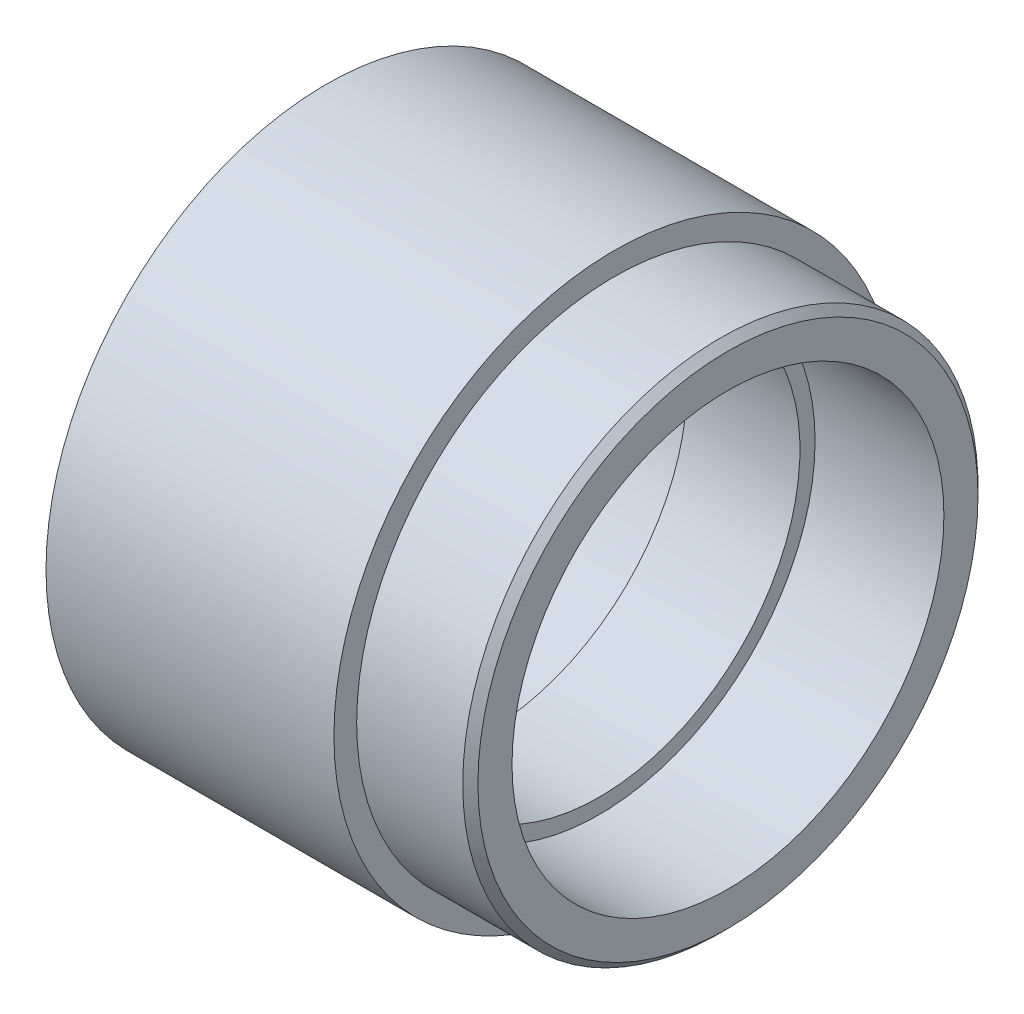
ISO-10303-21;
HEADER;
FILE_DESCRIPTION(('STEP AP214'),'2;1');
FILE_NAME('part.step','',(''),(''),'','','');
FILE_SCHEMA(('AUTOMOTIVE_DESIGN { 1 0 10303 214 1 1 1 1 }'));
ENDSEC;
DATA;
#1=APPLICATION_CONTEXT('core data for automotive mechanical design processes');
#2=APPLICATION_PROTOCOL_DEFINITION('international standard','automotive_design',2000,#1);
#3=PRODUCT_CONTEXT('',#1,'mechanical');
#4=PRODUCT('Part','Part','',(#3));
#5=PRODUCT_RELATED_PRODUCT_CATEGORY('part','',(#4));
#6=PRODUCT_DEFINITION_FORMATION('','',#4);
#7=PRODUCT_DEFINITION_CONTEXT('part definition',#1,'design');
#8=PRODUCT_DEFINITION('design','',#6,#7);
#9=PRODUCT_DEFINITION_SHAPE('','',#8);
#10=(LENGTH_UNIT() NAMED_UNIT(*) SI_UNIT(.MILLI.,.METRE.));
#11=(NAMED_UNIT(*) PLANE_ANGLE_UNIT() SI_UNIT($,.RADIAN.));
#12=(NAMED_UNIT(*) SI_UNIT($,.STERADIAN.) SOLID_ANGLE_UNIT());
#13=UNCERTAINTY_MEASURE_WITH_UNIT(LENGTH_MEASURE(1.E-05),#10,'distance_accuracy_value','');
#14=(GEOMETRIC_REPRESENTATION_CONTEXT(3) GLOBAL_UNCERTAINTY_ASSIGNED_CONTEXT((#13)) GLOBAL_UNIT_ASSIGNED_CONTEXT((#10,
#11,#12)) REPRESENTATION_CONTEXT('',''));
#15=CARTESIAN_POINT('',(0.,0.,0.));
#16=DIRECTION('',(0.,0.,1.));
#17=DIRECTION('',(1.,0.,0.));
#18=AXIS2_PLACEMENT_3D('',#15,#16,#17);
#19=CARTESIAN_POINT('',(11.104537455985,37.,0.));
#20=DIRECTION('',(1.,0.,0.));
#21=DIRECTION('',(0.,0.,-1.));
#22=AXIS2_PLACEMENT_3D('',#19,#20,#21);
#23=PLANE('',#22);
#24=CARTESIAN_POINT('',(11.104537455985,3.40419627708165E-13,-32.5));
#25=DIRECTION('',(-1.,0.,0.));
#26=DIRECTION('',(0.,0.,1.));
#27=AXIS2_PLACEMENT_3D('',#24,#25,#26);
#28=CIRCLE('',#27,2.);
#29=CARTESIAN_POINT('',(11.104537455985,3.40419627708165E-13,-30.5));
#30=VERTEX_POINT('',#29);
#31=EDGE_CURVE('E68',#30,#30,#28,.T.);
#32=ORIENTED_EDGE('',*,*,#31,.F.);
#33=EDGE_LOOP('',(#32));
#34=FACE_BOUND('',#33,.T.);
#35=CARTESIAN_POINT('',(11.104537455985,-32.5,-2.2694641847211E-13));
#36=DIRECTION('',(-1.,0.,0.));
#37=DIRECTION('',(0.,0.,1.));
#38=AXIS2_PLACEMENT_3D('',#35,#36,#37);
#39=CIRCLE('',#38,2.);
#40=CARTESIAN_POINT('',(11.104537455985,-32.5,1.99999999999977));
#41=VERTEX_POINT('',#40);
#42=EDGE_CURVE('E80',#41,#41,#39,.T.);
#43=ORIENTED_EDGE('',*,*,#42,.F.);
#44=EDGE_LOOP('',(#43));
#45=FACE_BOUND('',#44,.T.);
#46=CARTESIAN_POINT('',(11.104537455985,-1.13473209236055E-13,32.5));
#47=DIRECTION('',(-1.,0.,0.));
#48=DIRECTION('',(0.,0.,1.));
#49=AXIS2_PLACEMENT_3D('',#46,#47,#48);
#50=CIRCLE('',#49,2.);
#51=CARTESIAN_POINT('',(11.104537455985,-1.13473209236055E-13,34.5));
#52=VERTEX_POINT('',#51);
#53=EDGE_CURVE('E92',#52,#52,#50,.T.);
#54=ORIENTED_EDGE('',*,*,#53,.F.);
#55=EDGE_LOOP('',(#54));
#56=FACE_BOUND('',#55,.T.);
#57=CARTESIAN_POINT('',(11.104537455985,32.5,0.));
#58=DIRECTION('',(-1.,0.,0.));
#59=DIRECTION('',(0.,0.,1.));
#60=AXIS2_PLACEMENT_3D('',#57,#58,#59);
#61=CIRCLE('',#60,1.99999999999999);
#62=CARTESIAN_POINT('',(11.104537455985,32.5,1.99999999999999));
#63=VERTEX_POINT('',#62);
#64=EDGE_CURVE('E104',#63,#63,#61,.T.);
#65=ORIENTED_EDGE('',*,*,#64,.F.);
#66=EDGE_LOOP('',(#65));
#67=FACE_BOUND('',#66,.T.);
#68=CARTESIAN_POINT('',(11.104537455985,0.,0.));
#69=DIRECTION('',(1.,0.,0.));
#70=DIRECTION('',(0.,0.,-1.));
#71=AXIS2_PLACEMENT_3D('',#68,#69,#70);
#72=CIRCLE('',#71,29.5);
#73=CARTESIAN_POINT('',(11.104537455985,0.,-29.5));
#74=VERTEX_POINT('',#73);
#75=EDGE_CURVE('E134',#74,#74,#72,.T.);
#76=ORIENTED_EDGE('',*,*,#75,.T.);
#77=EDGE_LOOP('',(#76));
#78=FACE_BOUND('',#77,.T.);
#79=CARTESIAN_POINT('',(11.104537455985,0.,0.));
#80=DIRECTION('',(-1.,0.,0.));
#81=DIRECTION('',(0.,0.,1.));
#82=AXIS2_PLACEMENT_3D('',#79,#80,#81);
#83=CIRCLE('',#82,37.);
#84=CARTESIAN_POINT('',(11.104537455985,0.,37.));
#85=VERTEX_POINT('',#84);
#86=EDGE_CURVE('E128',#85,#85,#83,.T.);
#87=ORIENTED_EDGE('',*,*,#86,.T.);
#88=EDGE_LOOP('',(#87));
#89=FACE_BOUND('',#88,.T.);
#90=ADVANCED_FACE('F31',(#34,#45,#56,#67,#78,#89),#23,.F.);
#91=CARTESIAN_POINT('',(-8.50676589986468,0.,0.));
#92=DIRECTION('',(-1.,0.,0.));
#93=DIRECTION('',(0.,0.,1.));
#94=AXIS2_PLACEMENT_3D('',#91,#92,#93);
#95=CYLINDRICAL_SURFACE('',#94,37.);
#96=ORIENTED_EDGE('',*,*,#86,.F.);
#97=EDGE_LOOP('',(#96));
#98=FACE_BOUND('',#97,.T.);
#99=CARTESIAN_POINT('',(49.104537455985,0.,0.));
#100=DIRECTION('',(-1.,0.,0.));
#101=DIRECTION('',(0.,0.,1.));
#102=AXIS2_PLACEMENT_3D('',#99,#100,#101);
#103=CIRCLE('',#102,37.);
#104=CARTESIAN_POINT('',(49.104537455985,0.,37.));
#105=VERTEX_POINT('',#104);
#106=EDGE_CURVE('E125',#105,#105,#103,.T.);
#107=ORIENTED_EDGE('',*,*,#106,.T.);
#108=EDGE_LOOP('',(#107));
#109=FACE_BOUND('',#108,.T.);
#110=ADVANCED_FACE('F160',(#98,#109),#95,.T.);
#111=CARTESIAN_POINT('',(49.104537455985,34.,0.));
#112=DIRECTION('',(-1.,0.,0.));
#113=DIRECTION('',(0.,0.,1.));
#114=AXIS2_PLACEMENT_3D('',#111,#112,#113);
#115=PLANE('',#114);
#116=ORIENTED_EDGE('',*,*,#106,.F.);
#117=EDGE_LOOP('',(#116));
#118=FACE_BOUND('',#117,.T.);
#119=CARTESIAN_POINT('',(49.104537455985,0.,0.));
#120=DIRECTION('',(-1.,0.,0.));
#121=DIRECTION('',(0.,0.,1.));
#122=AXIS2_PLACEMENT_3D('',#119,#120,#121);
#123=CIRCLE('',#122,34.);
#124=CARTESIAN_POINT('',(49.104537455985,0.,34.));
#125=VERTEX_POINT('',#124);
#126=EDGE_CURVE('E122',#125,#125,#123,.T.);
#127=ORIENTED_EDGE('',*,*,#126,.T.);
#128=EDGE_LOOP('',(#127));
#129=FACE_BOUND('',#128,.T.);
#130=ADVANCED_FACE('F167',(#118,#129),#115,.F.);
#131=CARTESIAN_POINT('',(-8.50676589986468,0.,0.));
#132=DIRECTION('',(-1.,0.,0.));
#133=DIRECTION('',(0.,0.,1.));
#134=AXIS2_PLACEMENT_3D('',#131,#132,#133);
#135=CYLINDRICAL_SURFACE('',#134,34.);
#136=CARTESIAN_POINT('',(63.104537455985,0.,0.));
#137=DIRECTION('',(-1.,0.,0.));
#138=DIRECTION('',(0.,0.,1.));
#139=AXIS2_PLACEMENT_3D('',#136,#137,#138);
#140=CIRCLE('',#139,34.);
#141=CARTESIAN_POINT('',(63.104537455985,0.,34.));
#142=VERTEX_POINT('',#141);
#143=EDGE_CURVE('E38',#142,#142,#140,.T.);
#144=ORIENTED_EDGE('',*,*,#143,.T.);
#145=EDGE_LOOP('',(#144));
#146=FACE_BOUND('',#145,.T.);
#147=ORIENTED_EDGE('',*,*,#126,.F.);
#148=EDGE_LOOP('',(#147));
#149=FACE_BOUND('',#148,.T.);
#150=ADVANCED_FACE('F139',(#146,#149),#135,.T.);
#151=CARTESIAN_POINT('',(64.104537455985,28.5,0.));
#152=DIRECTION('',(-1.,0.,0.));
#153=DIRECTION('',(0.,0.,1.));
#154=AXIS2_PLACEMENT_3D('',#151,#152,#153);
#155=PLANE('',#154);
#156=CARTESIAN_POINT('',(64.104537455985,0.,0.));
#157=DIRECTION('',(-1.,0.,0.));
#158=DIRECTION('',(0.,0.,1.));
#159=AXIS2_PLACEMENT_3D('',#156,#157,#158);
#160=CIRCLE('',#159,33.);
#161=CARTESIAN_POINT('',(64.104537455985,0.,33.));
#162=VERTEX_POINT('',#161);
#163=EDGE_CURVE('E11',#162,#162,#160,.F.);
#164=ORIENTED_EDGE('',*,*,#163,.T.);
#165=EDGE_LOOP('',(#164));
#166=FACE_BOUND('',#165,.T.);
#167=CARTESIAN_POINT('',(64.104537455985,0.,0.));
#168=DIRECTION('',(-1.,0.,0.));
#169=DIRECTION('',(0.,0.,1.));
#170=AXIS2_PLACEMENT_3D('',#167,#168,#169);
#171=CIRCLE('',#170,28.5);
#172=CARTESIAN_POINT('',(64.104537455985,0.,28.5));
#173=VERTEX_POINT('',#172);
#174=EDGE_CURVE('E119',#173,#173,#171,.T.);
#175=ORIENTED_EDGE('',*,*,#174,.T.);
#176=EDGE_LOOP('',(#175));
#177=FACE_BOUND('',#176,.T.);
#178=ADVANCED_FACE('F188',(#166,#177),#155,.F.);
#179=CARTESIAN_POINT('',(-8.50676589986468,0.,0.));
#180=DIRECTION('',(-1.,0.,0.));
#181=DIRECTION('',(0.,0.,1.));
#182=AXIS2_PLACEMENT_3D('',#179,#180,#181);
#183=CYLINDRICAL_SURFACE('',#182,28.5);
#184=ORIENTED_EDGE('',*,*,#174,.F.);
#185=EDGE_LOOP('',(#184));
#186=FACE_BOUND('',#185,.T.);
#187=CARTESIAN_POINT('',(47.104537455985,0.,0.));
#188=DIRECTION('',(-1.,0.,0.));
#189=DIRECTION('',(0.,0.,1.));
#190=AXIS2_PLACEMENT_3D('',#187,#188,#189);
#191=CIRCLE('',#190,28.5);
#192=CARTESIAN_POINT('',(47.104537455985,0.,28.5));
#193=VERTEX_POINT('',#192);
#194=EDGE_CURVE('E116',#193,#193,#191,.T.);
#195=ORIENTED_EDGE('',*,*,#194,.T.);
#196=EDGE_LOOP('',(#195));
#197=FACE_BOUND('',#196,.T.);
#198=ADVANCED_FACE('F194',(#186,#197),#183,.F.);
#199=CARTESIAN_POINT('',(47.104537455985,26.5,0.));
#200=DIRECTION('',(-1.,0.,0.));
#201=DIRECTION('',(0.,0.,1.));
#202=AXIS2_PLACEMENT_3D('',#199,#200,#201);
#203=PLANE('',#202);
#204=ORIENTED_EDGE('',*,*,#194,.F.);
#205=EDGE_LOOP('',(#204));
#206=FACE_BOUND('',#205,.T.);
#207=CARTESIAN_POINT('',(47.104537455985,0.,0.));
#208=DIRECTION('',(-1.,0.,0.));
#209=DIRECTION('',(0.,0.,1.));
#210=AXIS2_PLACEMENT_3D('',#207,#208,#209);
#211=CIRCLE('',#210,26.5);
#212=CARTESIAN_POINT('',(47.104537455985,0.,26.5));
#213=VERTEX_POINT('',#212);
#214=EDGE_CURVE('E113',#213,#213,#211,.T.);
#215=ORIENTED_EDGE('',*,*,#214,.T.);
#216=EDGE_LOOP('',(#215));
#217=FACE_BOUND('',#216,.T.);
#218=ADVANCED_FACE('F200',(#206,#217),#203,.F.);
#219=CARTESIAN_POINT('',(-8.50676589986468,0.,0.));
#220=DIRECTION('',(-1.,0.,0.));
#221=DIRECTION('',(0.,0.,1.));
#222=AXIS2_PLACEMENT_3D('',#219,#220,#221);
#223=CYLINDRICAL_SURFACE('',#222,26.5);
#224=ORIENTED_EDGE('',*,*,#214,.F.);
#225=EDGE_LOOP('',(#224));
#226=FACE_BOUND('',#225,.T.);
#227=CARTESIAN_POINT('',(32.2121333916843,0.,0.));
#228=DIRECTION('',(-1.,0.,0.));
#229=DIRECTION('',(0.,0.,1.));
#230=AXIS2_PLACEMENT_3D('',#227,#228,#229);
#231=CIRCLE('',#230,26.5);
#232=CARTESIAN_POINT('',(32.2121333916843,0.,26.5));
#233=VERTEX_POINT('',#232);
#234=EDGE_CURVE('E110',#233,#233,#231,.T.);
#235=ORIENTED_EDGE('',*,*,#234,.T.);
#236=EDGE_LOOP('',(#235));
#237=FACE_BOUND('',#236,.T.);
#238=ADVANCED_FACE('F204',(#226,#237),#223,.F.);
#239=CARTESIAN_POINT('',(32.2121333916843,28.5,0.));
#240=DIRECTION('',(1.,0.,0.));
#241=DIRECTION('',(0.,0.,-1.));
#242=AXIS2_PLACEMENT_3D('',#239,#240,#241);
#243=PLANE('',#242);
#244=ORIENTED_EDGE('',*,*,#234,.F.);
#245=EDGE_LOOP('',(#244));
#246=FACE_BOUND('',#245,.T.);
#247=CARTESIAN_POINT('',(32.2121333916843,0.,0.));
#248=DIRECTION('',(-1.,0.,0.));
#249=DIRECTION('',(0.,0.,1.));
#250=AXIS2_PLACEMENT_3D('',#247,#248,#249);
#251=CIRCLE('',#250,28.5);
#252=CARTESIAN_POINT('',(32.2121333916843,0.,28.5));
#253=VERTEX_POINT('',#252);
#254=EDGE_CURVE('E107',#253,#253,#251,.T.);
#255=ORIENTED_EDGE('',*,*,#254,.T.);
#256=EDGE_LOOP('',(#255));
#257=FACE_BOUND('',#256,.T.);
#258=ADVANCED_FACE('F208',(#246,#257),#243,.F.);
#259=CARTESIAN_POINT('',(-8.50676589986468,0.,0.));
#260=DIRECTION('',(-1.,0.,0.));
#261=DIRECTION('',(0.,0.,1.));
#262=AXIS2_PLACEMENT_3D('',#259,#260,#261);
#263=CYLINDRICAL_SURFACE('',#262,28.5);
#264=CARTESIAN_POINT('',(12.104537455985,0.,0.));
#265=DIRECTION('',(1.,0.,0.));
#266=DIRECTION('',(0.,0.,-1.));
#267=AXIS2_PLACEMENT_3D('',#264,#265,#266);
#268=CIRCLE('',#267,28.5);
#269=CARTESIAN_POINT('',(12.104537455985,0.,-28.5));
#270=VERTEX_POINT('',#269);
#271=EDGE_CURVE('E131',#270,#270,#268,.F.);
#272=ORIENTED_EDGE('',*,*,#271,.T.);
#273=EDGE_LOOP('',(#272));
#274=FACE_BOUND('',#273,.T.);
#275=ORIENTED_EDGE('',*,*,#254,.F.);
#276=EDGE_LOOP('',(#275));
#277=FACE_BOUND('',#276,.T.);
#278=ADVANCED_FACE('F155',(#274,#277),#263,.F.);
#279=CARTESIAN_POINT('',(12.104537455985,0.,0.));
#280=DIRECTION('',(-1.,0.,0.));
#281=DIRECTION('',(0.,0.,1.));
#282=AXIS2_PLACEMENT_3D('',#279,#280,#281);
#283=CONICAL_SURFACE('',#282,28.5,0.785398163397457);
#284=ORIENTED_EDGE('',*,*,#75,.F.);
#285=EDGE_LOOP('',(#284));
#286=FACE_BOUND('',#285,.T.);
#287=ORIENTED_EDGE('',*,*,#271,.F.);
#288=EDGE_LOOP('',(#287));
#289=FACE_BOUND('',#288,.T.);
#290=ADVANCED_FACE('F145',(#286,#289),#283,.F.);
#291=CARTESIAN_POINT('',(63.104537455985,0.,0.));
#292=DIRECTION('',(-1.,0.,0.));
#293=DIRECTION('',(0.,0.,1.));
#294=AXIS2_PLACEMENT_3D('',#291,#292,#293);
#295=CONICAL_SURFACE('',#294,34.,0.785398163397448);
#296=ORIENTED_EDGE('',*,*,#163,.F.);
#297=EDGE_LOOP('',(#296));
#298=FACE_BOUND('',#297,.T.);
#299=ORIENTED_EDGE('',*,*,#143,.F.);
#300=EDGE_LOOP('',(#299));
#301=FACE_BOUND('',#300,.T.);
#302=ADVANCED_FACE('F142',(#298,#301),#295,.T.);
#303=CARTESIAN_POINT('',(11.104537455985,32.5,0.));
#304=DIRECTION('',(-1.,0.,0.));
#305=DIRECTION('',(0.,0.,1.));
#306=AXIS2_PLACEMENT_3D('',#303,#304,#305);
#307=CYLINDRICAL_SURFACE('',#306,1.99999999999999);
#308=CARTESIAN_POINT('',(19.104537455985,32.5,0.));
#309=DIRECTION('',(-1.,0.,0.));
#310=DIRECTION('',(0.,0.,1.));
#311=AXIS2_PLACEMENT_3D('',#308,#309,#310);
#312=CIRCLE('',#311,1.99999999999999);
#313=CARTESIAN_POINT('',(19.104537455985,32.5,1.99999999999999));
#314=VERTEX_POINT('',#313);
#315=EDGE_CURVE('E101',#314,#314,#312,.T.);
#316=ORIENTED_EDGE('',*,*,#315,.F.);
#317=EDGE_LOOP('',(#316));
#318=FACE_BOUND('',#317,.T.);
#319=ORIENTED_EDGE('',*,*,#64,.T.);
#320=EDGE_LOOP('',(#319));
#321=FACE_BOUND('',#320,.T.);
#322=ADVANCED_FACE('F144',(#318,#321),#307,.F.);
#323=CARTESIAN_POINT('',(19.104537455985,34.15,0.));
#324=DIRECTION('',(1.,0.,0.));
#325=DIRECTION('',(0.,0.,-1.));
#326=AXIS2_PLACEMENT_3D('',#323,#324,#325);
#327=PLANE('',#326);
#328=CARTESIAN_POINT('',(19.104537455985,32.5,0.));
#329=DIRECTION('',(-1.,0.,0.));
#330=DIRECTION('',(0.,0.,1.));
#331=AXIS2_PLACEMENT_3D('',#328,#329,#330);
#332=CIRCLE('',#331,1.65);
#333=CARTESIAN_POINT('',(19.104537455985,32.5,1.65));
#334=VERTEX_POINT('',#333);
#335=EDGE_CURVE('E98',#334,#334,#332,.T.);
#336=ORIENTED_EDGE('',*,*,#335,.F.);
#337=EDGE_LOOP('',(#336));
#338=FACE_BOUND('',#337,.T.);
#339=ORIENTED_EDGE('',*,*,#315,.T.);
#340=EDGE_LOOP('',(#339));
#341=FACE_BOUND('',#340,.T.);
#342=ADVANCED_FACE('F152',(#338,#341),#327,.F.);
#343=CARTESIAN_POINT('',(11.104537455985,32.5,0.));
#344=DIRECTION('',(-1.,0.,0.));
#345=DIRECTION('',(0.,0.,1.));
#346=AXIS2_PLACEMENT_3D('',#343,#344,#345);
#347=CYLINDRICAL_SURFACE('',#346,1.65);
#348=CARTESIAN_POINT('',(21.204537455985,32.5,0.));
#349=DIRECTION('',(-1.,0.,0.));
#350=DIRECTION('',(0.,0.,1.));
#351=AXIS2_PLACEMENT_3D('',#348,#349,#350);
#352=CIRCLE('',#351,1.65);
#353=CARTESIAN_POINT('',(21.204537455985,32.5,1.65));
#354=VERTEX_POINT('',#353);
#355=EDGE_CURVE('E95',#354,#354,#352,.T.);
#356=ORIENTED_EDGE('',*,*,#355,.F.);
#357=EDGE_LOOP('',(#356));
#358=FACE_BOUND('',#357,.T.);
#359=ORIENTED_EDGE('',*,*,#335,.T.);
#360=EDGE_LOOP('',(#359));
#361=FACE_BOUND('',#360,.T.);
#362=ADVANCED_FACE('F241',(#358,#361),#347,.F.);
#363=CARTESIAN_POINT('',(21.204537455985,32.5,0.));
#364=DIRECTION('',(-1.,0.,0.));
#365=DIRECTION('',(0.,0.,1.));
#366=AXIS2_PLACEMENT_3D('',#363,#364,#365);
#367=CONICAL_SURFACE('',#366,1.65,1.02974425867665);
#368=CARTESIAN_POINT('',(22.1959574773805,32.5,0.));
#369=VERTEX_POINT('',#368);
#370=VERTEX_LOOP('',#369);
#371=FACE_BOUND('',#370,.T.);
#372=ORIENTED_EDGE('',*,*,#355,.T.);
#373=EDGE_LOOP('',(#372));
#374=FACE_BOUND('',#373,.T.);
#375=ADVANCED_FACE('F249',(#371,#374),#367,.F.);
#376=CARTESIAN_POINT('',(11.104537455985,-1.13473209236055E-13,32.5));
#377=DIRECTION('',(-1.,0.,0.));
#378=DIRECTION('',(0.,0.,1.));
#379=AXIS2_PLACEMENT_3D('',#376,#377,#378);
#380=CYLINDRICAL_SURFACE('',#379,2.);
#381=CARTESIAN_POINT('',(19.104537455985,-1.13473209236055E-13,32.5));
#382=DIRECTION('',(-1.,0.,0.));
#383=DIRECTION('',(0.,0.,1.));
#384=AXIS2_PLACEMENT_3D('',#381,#382,#383);
#385=CIRCLE('',#384,2.);
#386=CARTESIAN_POINT('',(19.104537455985,-1.13473209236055E-13,34.5));
#387=VERTEX_POINT('',#386);
#388=EDGE_CURVE('E89',#387,#387,#385,.T.);
#389=ORIENTED_EDGE('',*,*,#388,.F.);
#390=EDGE_LOOP('',(#389));
#391=FACE_BOUND('',#390,.T.);
#392=ORIENTED_EDGE('',*,*,#53,.T.);
#393=EDGE_LOOP('',(#392));
#394=FACE_BOUND('',#393,.T.);
#395=ADVANCED_FACE('F256',(#391,#394),#380,.F.);
#396=CARTESIAN_POINT('',(19.104537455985,1.64999999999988,32.5));
#397=DIRECTION('',(1.,0.,0.));
#398=DIRECTION('',(0.,0.,-1.));
#399=AXIS2_PLACEMENT_3D('',#396,#397,#398);
#400=PLANE('',#399);
#401=CARTESIAN_POINT('',(19.104537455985,-1.13473209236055E-13,32.5));
#402=DIRECTION('',(-1.,0.,0.));
#403=DIRECTION('',(0.,0.,1.));
#404=AXIS2_PLACEMENT_3D('',#401,#402,#403);
#405=CIRCLE('',#404,1.65);
#406=CARTESIAN_POINT('',(19.104537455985,-1.13473209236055E-13,34.15));
#407=VERTEX_POINT('',#406);
#408=EDGE_CURVE('E86',#407,#407,#405,.T.);
#409=ORIENTED_EDGE('',*,*,#408,.F.);
#410=EDGE_LOOP('',(#409));
#411=FACE_BOUND('',#410,.T.);
#412=ORIENTED_EDGE('',*,*,#388,.T.);
#413=EDGE_LOOP('',(#412));
#414=FACE_BOUND('',#413,.T.);
#415=ADVANCED_FACE('F262',(#411,#414),#400,.F.);
#416=CARTESIAN_POINT('',(11.104537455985,-1.13473209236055E-13,32.5));
#417=DIRECTION('',(-1.,0.,0.));
#418=DIRECTION('',(0.,0.,1.));
#419=AXIS2_PLACEMENT_3D('',#416,#417,#418);
#420=CYLINDRICAL_SURFACE('',#419,1.65);
#421=CARTESIAN_POINT('',(21.204537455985,-1.13473209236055E-13,32.5));
#422=DIRECTION('',(-1.,0.,0.));
#423=DIRECTION('',(0.,0.,1.));
#424=AXIS2_PLACEMENT_3D('',#421,#422,#423);
#425=CIRCLE('',#424,1.65);
#426=CARTESIAN_POINT('',(21.204537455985,-1.13473209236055E-13,34.15));
#427=VERTEX_POINT('',#426);
#428=EDGE_CURVE('E83',#427,#427,#425,.T.);
#429=ORIENTED_EDGE('',*,*,#428,.F.);
#430=EDGE_LOOP('',(#429));
#431=FACE_BOUND('',#430,.T.);
#432=ORIENTED_EDGE('',*,*,#408,.T.);
#433=EDGE_LOOP('',(#432));
#434=FACE_BOUND('',#433,.T.);
#435=ADVANCED_FACE('F270',(#431,#434),#420,.F.);
#436=CARTESIAN_POINT('',(21.204537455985,-1.13473209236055E-13,32.5));
#437=DIRECTION('',(-1.,0.,0.));
#438=DIRECTION('',(0.,0.,1.));
#439=AXIS2_PLACEMENT_3D('',#436,#437,#438);
#440=CONICAL_SURFACE('',#439,1.65,1.02974425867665);
#441=CARTESIAN_POINT('',(22.1959574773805,-1.16189733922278E-13,32.5));
#442=VERTEX_POINT('',#441);
#443=VERTEX_LOOP('',#442);
#444=FACE_BOUND('',#443,.T.);
#445=ORIENTED_EDGE('',*,*,#428,.T.);
#446=EDGE_LOOP('',(#445));
#447=FACE_BOUND('',#446,.T.);
#448=ADVANCED_FACE('F278',(#444,#447),#440,.F.);
#449=CARTESIAN_POINT('',(11.104537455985,-32.5,-2.2694641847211E-13));
#450=DIRECTION('',(-1.,0.,0.));
#451=DIRECTION('',(0.,0.,1.));
#452=AXIS2_PLACEMENT_3D('',#449,#450,#451);
#453=CYLINDRICAL_SURFACE('',#452,2.);
#454=CARTESIAN_POINT('',(19.104537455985,-32.5,-2.2694641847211E-13));
#455=DIRECTION('',(-1.,0.,0.));
#456=DIRECTION('',(0.,0.,1.));
#457=AXIS2_PLACEMENT_3D('',#454,#455,#456);
#458=CIRCLE('',#457,1.99999999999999);
#459=CARTESIAN_POINT('',(19.104537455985,-32.5,1.99999999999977));
#460=VERTEX_POINT('',#459);
#461=EDGE_CURVE('E77',#460,#460,#458,.T.);
#462=ORIENTED_EDGE('',*,*,#461,.F.);
#463=EDGE_LOOP('',(#462));
#464=FACE_BOUND('',#463,.T.);
#465=ORIENTED_EDGE('',*,*,#42,.T.);
#466=EDGE_LOOP('',(#465));
#467=FACE_BOUND('',#466,.T.);
#468=ADVANCED_FACE('F286',(#464,#467),#453,.F.);
#469=CARTESIAN_POINT('',(19.104537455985,-30.85,-2.2694641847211E-13));
#470=DIRECTION('',(1.,0.,0.));
#471=DIRECTION('',(0.,0.,-1.));
#472=AXIS2_PLACEMENT_3D('',#469,#470,#471);
#473=PLANE('',#472);
#474=CARTESIAN_POINT('',(19.104537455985,-32.5,-2.2694641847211E-13));
#475=DIRECTION('',(-1.,0.,0.));
#476=DIRECTION('',(0.,0.,1.));
#477=AXIS2_PLACEMENT_3D('',#474,#475,#476);
#478=CIRCLE('',#477,1.65);
#479=CARTESIAN_POINT('',(19.104537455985,-32.5,1.64999999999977));
#480=VERTEX_POINT('',#479);
#481=EDGE_CURVE('E74',#480,#480,#478,.T.);
#482=ORIENTED_EDGE('',*,*,#481,.F.);
#483=EDGE_LOOP('',(#482));
#484=FACE_BOUND('',#483,.T.);
#485=ORIENTED_EDGE('',*,*,#461,.T.);
#486=EDGE_LOOP('',(#485));
#487=FACE_BOUND('',#486,.T.);
#488=ADVANCED_FACE('F293',(#484,#487),#473,.F.);
#489=CARTESIAN_POINT('',(11.104537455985,-32.5,-2.2694641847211E-13));
#490=DIRECTION('',(-1.,0.,0.));
#491=DIRECTION('',(0.,0.,1.));
#492=AXIS2_PLACEMENT_3D('',#489,#490,#491);
#493=CYLINDRICAL_SURFACE('',#492,1.65);
#494=CARTESIAN_POINT('',(21.204537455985,-32.5,-2.2694641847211E-13));
#495=DIRECTION('',(-1.,0.,0.));
#496=DIRECTION('',(0.,0.,1.));
#497=AXIS2_PLACEMENT_3D('',#494,#495,#496);
#498=CIRCLE('',#497,1.65);
#499=CARTESIAN_POINT('',(21.204537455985,-32.5,1.64999999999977));
#500=VERTEX_POINT('',#499);
#501=EDGE_CURVE('E71',#500,#500,#498,.T.);
#502=ORIENTED_EDGE('',*,*,#501,.F.);
#503=EDGE_LOOP('',(#502));
#504=FACE_BOUND('',#503,.T.);
#505=ORIENTED_EDGE('',*,*,#481,.T.);
#506=EDGE_LOOP('',(#505));
#507=FACE_BOUND('',#506,.T.);
#508=ADVANCED_FACE('F301',(#504,#507),#493,.F.);
#509=CARTESIAN_POINT('',(21.204537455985,-32.5,-2.2694641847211E-13));
#510=DIRECTION('',(-1.,0.,0.));
#511=DIRECTION('',(0.,0.,1.));
#512=AXIS2_PLACEMENT_3D('',#509,#510,#511);
#513=CONICAL_SURFACE('',#512,1.65,1.02974425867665);
#514=CARTESIAN_POINT('',(22.1959574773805,-32.5,-2.2694641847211E-13));
#515=VERTEX_POINT('',#514);
#516=VERTEX_LOOP('',#515);
#517=FACE_BOUND('',#516,.T.);
#518=ORIENTED_EDGE('',*,*,#501,.T.);
#519=EDGE_LOOP('',(#518));
#520=FACE_BOUND('',#519,.T.);
#521=ADVANCED_FACE('F309',(#517,#520),#513,.F.);
#522=CARTESIAN_POINT('',(11.104537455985,3.40419627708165E-13,-32.5));
#523=DIRECTION('',(-1.,0.,0.));
#524=DIRECTION('',(0.,0.,1.));
#525=AXIS2_PLACEMENT_3D('',#522,#523,#524);
#526=CYLINDRICAL_SURFACE('',#525,2.);
#527=CARTESIAN_POINT('',(19.104537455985,3.40419627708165E-13,-32.5));
#528=DIRECTION('',(-1.,0.,0.));
#529=DIRECTION('',(0.,0.,1.));
#530=AXIS2_PLACEMENT_3D('',#527,#528,#529);
#531=CIRCLE('',#530,2.);
#532=CARTESIAN_POINT('',(19.104537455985,3.40419627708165E-13,-30.5));
#533=VERTEX_POINT('',#532);
#534=EDGE_CURVE('E63',#533,#533,#531,.T.);
#535=ORIENTED_EDGE('',*,*,#534,.F.);
#536=EDGE_LOOP('',(#535));
#537=FACE_BOUND('',#536,.T.);
#538=ORIENTED_EDGE('',*,*,#31,.T.);
#539=EDGE_LOOP('',(#538));
#540=FACE_BOUND('',#539,.T.);
#541=ADVANCED_FACE('F317',(#537,#540),#526,.F.);
#542=CARTESIAN_POINT('',(19.104537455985,1.65000000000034,-32.5));
#543=DIRECTION('',(1.,0.,0.));
#544=DIRECTION('',(0.,0.,-1.));
#545=AXIS2_PLACEMENT_3D('',#542,#543,#544);
#546=PLANE('',#545);
#547=CARTESIAN_POINT('',(19.104537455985,3.40419627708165E-13,-32.5));
#548=DIRECTION('',(-1.,0.,0.));
#549=DIRECTION('',(0.,0.,1.));
#550=AXIS2_PLACEMENT_3D('',#547,#548,#549);
#551=CIRCLE('',#550,1.65);
#552=CARTESIAN_POINT('',(19.104537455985,3.40419627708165E-13,-30.85));
#553=VERTEX_POINT('',#552);
#554=EDGE_CURVE('E60',#553,#553,#551,.T.);
#555=ORIENTED_EDGE('',*,*,#554,.F.);
#556=EDGE_LOOP('',(#555));
#557=FACE_BOUND('',#556,.T.);
#558=ORIENTED_EDGE('',*,*,#534,.T.);
#559=EDGE_LOOP('',(#558));
#560=FACE_BOUND('',#559,.T.);
#561=ADVANCED_FACE('F325',(#557,#560),#546,.F.);
#562=CARTESIAN_POINT('',(11.104537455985,3.40419627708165E-13,-32.5));
#563=DIRECTION('',(-1.,0.,0.));
#564=DIRECTION('',(0.,0.,1.));
#565=AXIS2_PLACEMENT_3D('',#562,#563,#564);
#566=CYLINDRICAL_SURFACE('',#565,1.65);
#567=CARTESIAN_POINT('',(21.204537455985,3.40419627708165E-13,-32.5));
#568=DIRECTION('',(-1.,0.,0.));
#569=DIRECTION('',(0.,0.,1.));
#570=AXIS2_PLACEMENT_3D('',#567,#568,#569);
#571=CIRCLE('',#570,1.65);
#572=CARTESIAN_POINT('',(21.204537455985,3.40419627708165E-13,-30.85));
#573=VERTEX_POINT('',#572);
#574=EDGE_CURVE('E58',#573,#573,#571,.T.);
#575=ORIENTED_EDGE('',*,*,#574,.F.);
#576=EDGE_LOOP('',(#575));
#577=FACE_BOUND('',#576,.T.);
#578=ORIENTED_EDGE('',*,*,#554,.T.);
#579=EDGE_LOOP('',(#578));
#580=FACE_BOUND('',#579,.T.);
#581=ADVANCED_FACE('F54',(#577,#580),#566,.F.);
#582=CARTESIAN_POINT('',(21.204537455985,3.40419627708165E-13,-32.5));
#583=DIRECTION('',(-1.,0.,0.));
#584=DIRECTION('',(0.,0.,1.));
#585=AXIS2_PLACEMENT_3D('',#582,#583,#584);
#586=CONICAL_SURFACE('',#585,1.65,1.02974425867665);
#587=CARTESIAN_POINT('',(22.1959574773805,3.37703103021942E-13,-32.5));
#588=VERTEX_POINT('',#587);
#589=VERTEX_LOOP('',#588);
#590=FACE_BOUND('',#589,.T.);
#591=ORIENTED_EDGE('',*,*,#574,.T.);
#592=EDGE_LOOP('',(#591));
#593=FACE_BOUND('',#592,.T.);
#594=ADVANCED_FACE('F51',(#590,#593),#586,.F.);
#595=CLOSED_SHELL('',(#90,#110,#130,#150,#178,#198,#218,#238,#258,#278,#290,#302,#322,#342,#362,
#375,#395,#415,#435,#448,#468,#488,#508,#521,#541,#561,#581,#594));
#596=MANIFOLD_SOLID_BREP('B2',#595);
#597=ADVANCED_BREP_SHAPE_REPRESENTATION('',(#18,#596),#14);
#598=SHAPE_DEFINITION_REPRESENTATION(#9,#597);
ENDSEC;
END-ISO-10303-21;
